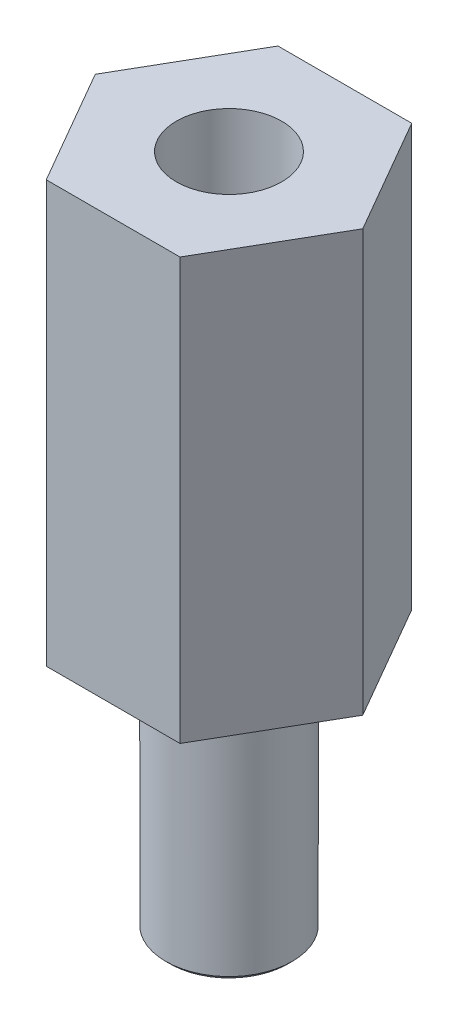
from build123d import *

# Parameters (mm, degrees)
SKETCH_1_R      = 1.25
EXTRUDE_1_DEPTH = 10
SKETCH_2_R      = 1.5
EXTRUDE_2_DEPTH = 6
CHAMFER_1_SIZE  = 0.1


with BuildPart() as part:
    # Sketch 1 → Extrude 1 (new body)
    with BuildSketch(Plane(origin=(0, 0, 0), x_dir=(1, 0, 0), z_dir=(0, 1, 0))):
        Polygon((3.175426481, 0), (1.58771324, 2.75), (-1.58771324, 2.75), (-3.175426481, 0), (-1.58771324, -2.75), (1.58771324, -2.75), align=None)
        with Locations(Location((0, 0, 0), (0, 0, 270))):
            Circle(SKETCH_1_R, mode=Mode.SUBTRACT)
    extrude(amount=EXTRUDE_1_DEPTH)

    # Sketch 2 → Extrude 2 (add)
    with BuildSketch(Plane.XZ):
        with Locations(Location((0, 0, 0), (0, 0, 90))):
            Circle(SKETCH_2_R)
    extrude(amount=EXTRUDE_2_DEPTH)

    # Chamfer 1
    chamfer_1_edges = [part.edges().sort_by_distance(p)[0] for p in [
        (0, -6, -1.5),
    ]]
    chamfer(chamfer_1_edges, length=CHAMFER_1_SIZE)


solid = part.part
